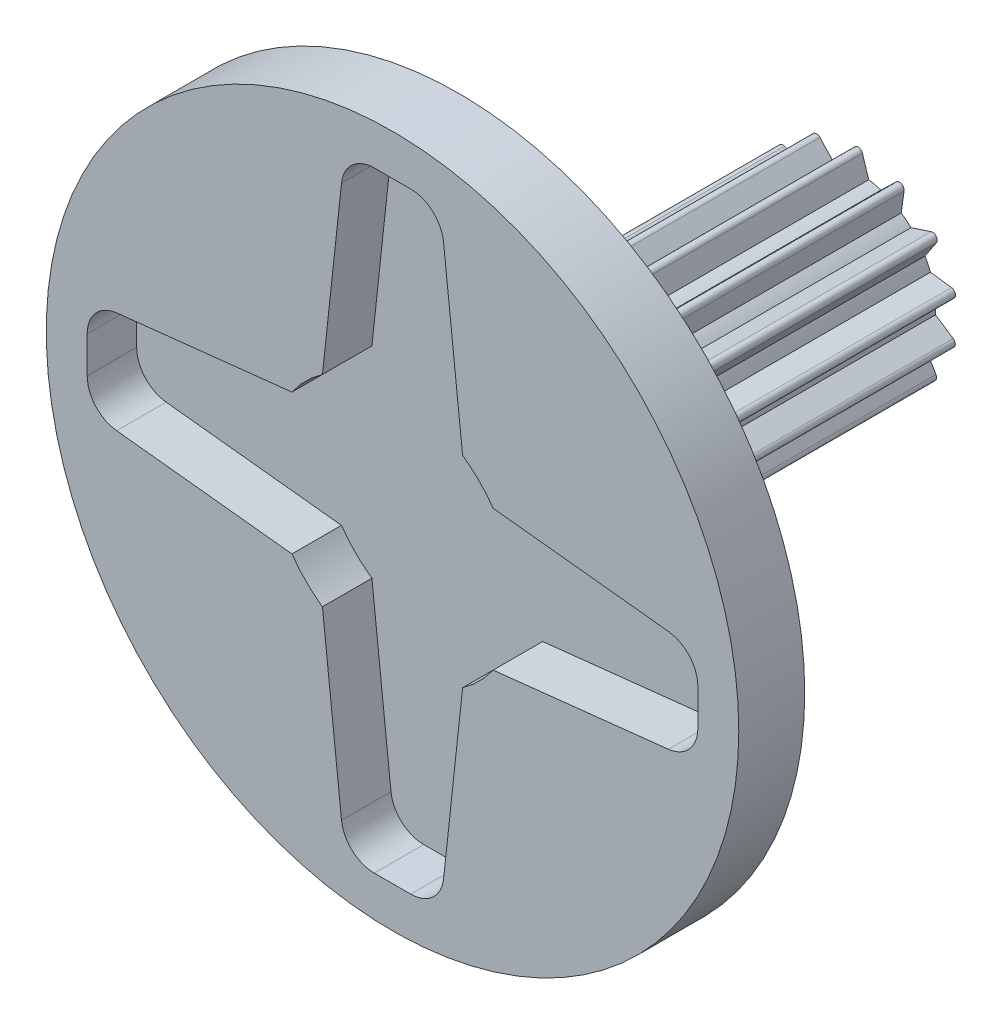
from build123d import *

# Parameters (mm, degrees)
SKETCH1_R           = 21
BOSS_EXTRUDE1_DEPTH = 3
BOSS_EXTRUDE2_START = -1
SKETCH2_R           = 21
BOSS_EXTRUDE2_DEPTH = 1
BOSS_EXTRUDE3_DEPTH = 25.2


with BuildPart() as part:
    # Sketch1 → Boss-Extrude1 (new body)
    with BuildSketch(Plane.XY):
        Circle(SKETCH1_R)
        with BuildLine():
            Line((4.531363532, 5.895416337), (4.25, 6.101367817))
            Line((4.25, 6.101367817), (3.093929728, 16.73261778))
            ThreePointArc((3.093929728, 16.73261778), (2.441236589, 18.005101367), (1.105650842, 18.516407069))
            Line((1.105650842, 18.516407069), (-1.105650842, 18.516407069))
            ThreePointArc((-1.105650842, 18.516407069), (-2.441236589, 18.005101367), (-3.093929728, 16.73261778))
            Line((-3.093929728, 16.73261778), (-4.25, 6.101367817))
            ThreePointArc((-4.25, 6.101367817), (-5.257812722, 5.257812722), (-6.101367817, 4.25))
            Line((-6.101367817, 4.25), (-16.73261778, 3.093929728))
            ThreePointArc((-16.73261778, 3.093929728), (-18.005101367, 2.441236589), (-18.516407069, 1.105650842))
            Line((-18.516407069, 1.105650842), (-18.516407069, -1.105650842))
            ThreePointArc((-18.516407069, -1.105650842), (-18.005101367, -2.441236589), (-16.73261778, -3.093929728))
            Line((-16.73261778, -3.093929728), (-6.101367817, -4.25))
            ThreePointArc((-6.101367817, -4.25), (-5.257812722, -5.257812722), (-4.25, -6.101367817))
            Line((-4.25, -6.101367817), (-3.093929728, -16.73261778))
            ThreePointArc((-3.093929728, -16.73261778), (-2.441236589, -18.005101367), (-1.105650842, -18.516407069))
            Line((-1.105650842, -18.516407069), (1.105650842, -18.516407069))
            ThreePointArc((1.105650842, -18.516407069), (2.441236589, -18.005101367), (3.093929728, -16.73261778))
            Line((3.093929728, -16.73261778), (4.25, -6.101367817))
            ThreePointArc((4.25, -6.101367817), (5.257812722, -5.257812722), (6.101367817, -4.25))
            Line((6.101367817, -4.25), (16.73261778, -3.093929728))
            ThreePointArc((16.73261778, -3.093929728), (18.005101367, -2.441236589), (18.516407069, -1.105650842))
            Line((18.516407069, -1.105650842), (18.516407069, 1.105650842))
            ThreePointArc((18.516407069, 1.105650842), (18.005101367, 2.441236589), (16.73261778, 3.093929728))
            Line((16.73261778, 3.093929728), (6.101367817, 4.25))
            ThreePointArc((6.101367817, 4.25), (5.379646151, 5.1330884), (4.531363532, 5.895416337))
        make_face(mode=Mode.SUBTRACT)
    extrude(amount=BOSS_EXTRUDE1_DEPTH)

    # Sketch2 → Boss-Extrude2 (add)
    with BuildSketch(Plane.XY.offset(BOSS_EXTRUDE2_START)):
        Circle(SKETCH2_R)
    extrude(amount=BOSS_EXTRUDE2_DEPTH)

    # Sketch3 → Boss-Extrude3 (add)
    with BuildSketch(Plane.XY):
        with BuildLine():
            Line((0.680593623, 4.693695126), (0.299151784, 5.887032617))
            ThreePointArc((0.299151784, 5.887032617), (0.03756395, 6.082721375), (-0.23279177, 5.899336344))
            Line((-0.23279177, 5.899336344), (-0.680593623, 4.693695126))
            ThreePointArc((-0.680593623, 4.693695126), (-1.055368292, 4.623870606), (-1.423324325, 4.52417169))
            Line((-1.423324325, 4.52417169), (-2.284761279, 5.433830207))
            ThreePointArc((-2.284761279, 5.433830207), (-2.605349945, 5.496640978), (-2.769364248, 5.214113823))
            Line((-2.769364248, 5.214113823), (-2.649711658, 3.933574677))
            ThreePointArc((-2.649711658, 3.933574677), (-2.957076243, 3.708056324), (-3.245335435, 3.458580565))
            Line((-3.245335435, 3.458580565), (-4.416149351, 3.904391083))
            ThreePointArc((-4.416149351, 3.904391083), (-4.73224233, 3.821883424), (-4.757430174, 3.496172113))
            Line((-4.757430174, 3.496172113), (-4.094021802, 2.394361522))
            ThreePointArc((-4.094021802, 2.394361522), (-4.273098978, 2.057816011), (-4.42456806, 1.707975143))
            Line((-4.42456806, 1.707975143), (-5.672864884, 1.601639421))
            ThreePointArc((-5.672864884, 1.601639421), (-5.921856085, 1.390154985), (-5.803228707, 1.085770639))
            Line((-5.803228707, 1.085770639), (-4.727460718, 0.380915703))
            ThreePointArc((-4.727460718, 0.380915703), (-4.742782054, 0), (-4.727460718, -0.380915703))
            Line((-4.727460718, -0.380915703), (-5.805999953, -1.018336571))
            ThreePointArc((-5.805999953, -1.018336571), (-5.938573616, -1.316910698), (-5.699626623, -1.539681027))
            Line((-5.699626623, -1.539681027), (-4.42456806, -1.707975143))
            ThreePointArc((-4.42456806, -1.707975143), (-4.273098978, -2.057816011), (-4.094021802, -2.394361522))
            Line((-4.094021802, -2.394361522), (-4.789185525, -3.436618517))
            ThreePointArc((-4.789185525, -3.436618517), (-4.77908381, -3.763146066), (-4.467143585, -3.860179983))
            Line((-4.467143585, -3.860179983), (-3.245335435, -3.458580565))
            ThreePointArc((-3.245335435, -3.458580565), (-2.957076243, -3.708056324), (-2.649711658, -3.933574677))
            Line((-2.649711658, -3.933574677), (-2.823814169, -5.174236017))
            ThreePointArc((-2.823814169, -5.174236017), (-2.673037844, -5.464044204), (-2.349887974, -5.41612295))
            Line((-2.349887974, -5.41612295), (-1.423324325, -4.52417169))
            ThreePointArc((-1.423324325, -4.52417169), (-1.055368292, -4.623870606), (-0.680593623, -4.693695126))
            Line((-0.680593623, -4.693695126), (-0.299151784, -5.887032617))
            ThreePointArc((-0.299151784, -5.887032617), (-0.03756395, -6.082721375), (0.23279177, -5.899336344))
            Line((0.23279177, -5.899336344), (0.680593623, -4.693695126))
            ThreePointArc((0.680593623, -4.693695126), (1.055368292, -4.623870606), (1.423324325, -4.52417169))
            Line((1.423324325, -4.52417169), (2.284761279, -5.433830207))
            ThreePointArc((2.284761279, -5.433830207), (2.605349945, -5.496640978), (2.769364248, -5.214113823))
            Line((2.769364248, -5.214113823), (2.649711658, -3.933574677))
            ThreePointArc((2.649711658, -3.933574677), (2.957076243, -3.708056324), (3.245335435, -3.458580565))
            Line((3.245335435, -3.458580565), (4.416149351, -3.904391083))
            ThreePointArc((4.416149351, -3.904391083), (4.73224233, -3.821883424), (4.757430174, -3.496172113))
            Line((4.757430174, -3.496172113), (4.094021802, -2.394361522))
            ThreePointArc((4.094021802, -2.394361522), (4.273098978, -2.057816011), (4.42456806, -1.707975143))
            Line((4.42456806, -1.707975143), (5.672864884, -1.601639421))
            ThreePointArc((5.672864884, -1.601639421), (5.921856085, -1.390154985), (5.803228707, -1.085770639))
            Line((5.803228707, -1.085770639), (4.727460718, -0.380915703))
            ThreePointArc((4.727460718, -0.380915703), (4.742782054, 0), (4.727460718, 0.380915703))
            Line((4.727460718, 0.380915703), (5.805999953, 1.018336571))
            ThreePointArc((5.805999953, 1.018336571), (5.938573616, 1.316910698), (5.699626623, 1.539681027))
            Line((5.699626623, 1.539681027), (4.42456806, 1.707975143))
            ThreePointArc((4.42456806, 1.707975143), (4.273098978, 2.057816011), (4.094021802, 2.394361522))
            Line((4.094021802, 2.394361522), (4.789185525, 3.436618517))
            ThreePointArc((4.789185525, 3.436618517), (4.77908381, 3.763146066), (4.467143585, 3.860179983))
            Line((4.467143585, 3.860179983), (3.245335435, 3.458580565))
            ThreePointArc((3.245335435, 3.458580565), (2.957076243, 3.708056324), (2.649711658, 3.933574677))
            Line((2.649711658, 3.933574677), (2.823814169, 5.174236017))
            ThreePointArc((2.823814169, 5.174236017), (2.673037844, 5.464044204), (2.349887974, 5.41612295))
            Line((2.349887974, 5.41612295), (1.423324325, 4.52417169))
            ThreePointArc((1.423324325, 4.52417169), (1.055368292, 4.623870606), (0.680593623, 4.693695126))
        make_face()
    extrude(amount=-BOSS_EXTRUDE3_DEPTH)


solid = part.part
